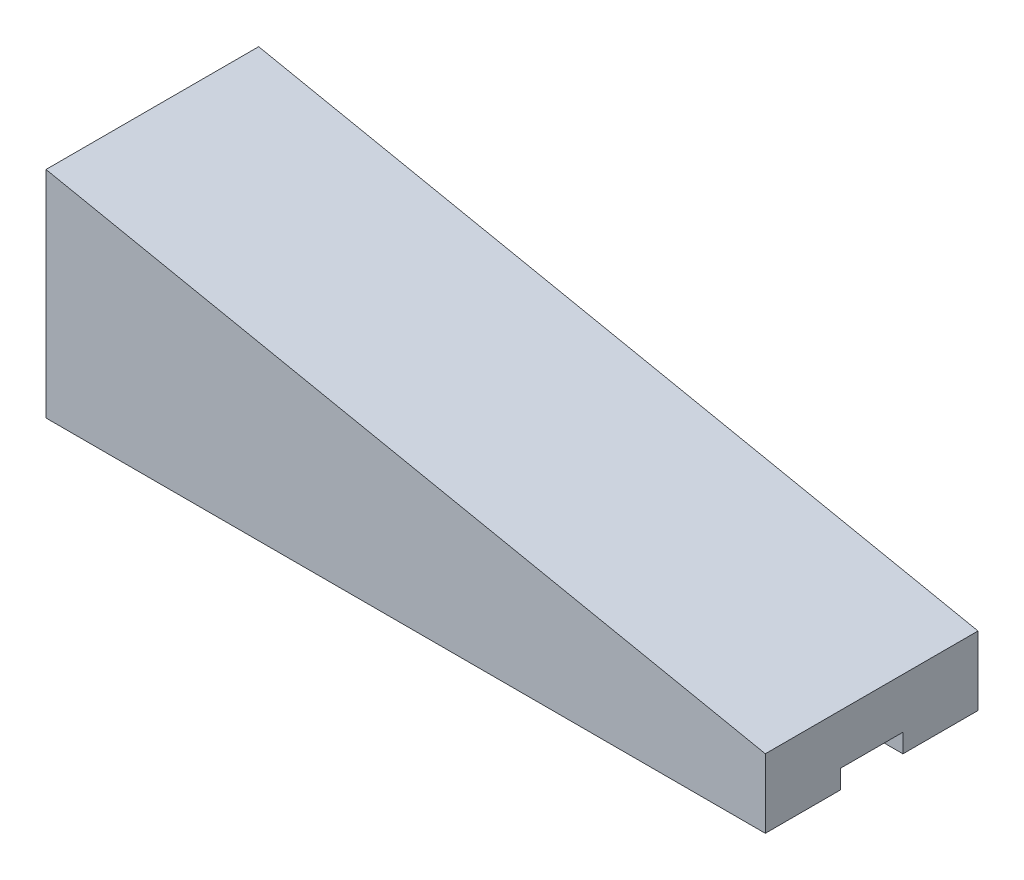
ISO-10303-21;
HEADER;
FILE_DESCRIPTION(('STEP AP214'),'2;1');
FILE_NAME('part.step','',(''),(''),'','','');
FILE_SCHEMA(('AUTOMOTIVE_DESIGN { 1 0 10303 214 1 1 1 1 }'));
ENDSEC;
DATA;
#1=APPLICATION_CONTEXT('core data for automotive mechanical design processes');
#2=APPLICATION_PROTOCOL_DEFINITION('international standard','automotive_design',2000,#1);
#3=PRODUCT_CONTEXT('',#1,'mechanical');
#4=PRODUCT('Part','Part','',(#3));
#5=PRODUCT_RELATED_PRODUCT_CATEGORY('part','',(#4));
#6=PRODUCT_DEFINITION_FORMATION('','',#4);
#7=PRODUCT_DEFINITION_CONTEXT('part definition',#1,'design');
#8=PRODUCT_DEFINITION('design','',#6,#7);
#9=PRODUCT_DEFINITION_SHAPE('','',#8);
#10=(LENGTH_UNIT() NAMED_UNIT(*) SI_UNIT(.MILLI.,.METRE.));
#11=(NAMED_UNIT(*) PLANE_ANGLE_UNIT() SI_UNIT($,.RADIAN.));
#12=(NAMED_UNIT(*) SI_UNIT($,.STERADIAN.) SOLID_ANGLE_UNIT());
#13=UNCERTAINTY_MEASURE_WITH_UNIT(LENGTH_MEASURE(1.E-05),#10,'distance_accuracy_value','');
#14=(GEOMETRIC_REPRESENTATION_CONTEXT(3) GLOBAL_UNCERTAINTY_ASSIGNED_CONTEXT((#13)) GLOBAL_UNIT_ASSIGNED_CONTEXT((#10,
#11,#12)) REPRESENTATION_CONTEXT('',''));
#15=CARTESIAN_POINT('',(0.,0.,0.));
#16=DIRECTION('',(0.,0.,1.));
#17=DIRECTION('',(1.,0.,0.));
#18=AXIS2_PLACEMENT_3D('',#15,#16,#17);
#19=CARTESIAN_POINT('',(-187.958768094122,40.,34.));
#20=DIRECTION('',(1.,0.,0.));
#21=DIRECTION('',(0.,0.,-1.));
#22=AXIS2_PLACEMENT_3D('',#19,#20,#21);
#23=CYLINDRICAL_SURFACE('',#22,22.);
#24=CARTESIAN_POINT('',(-177.958768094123,40.,34.));
#25=DIRECTION('',(1.,0.,0.));
#26=DIRECTION('',(0.,0.,-1.));
#27=AXIS2_PLACEMENT_3D('',#24,#25,#26);
#28=CIRCLE('',#27,22.);
#29=CARTESIAN_POINT('',(-177.958768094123,40.,12.));
#30=VERTEX_POINT('',#29);
#31=CARTESIAN_POINT('',(-177.958768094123,42.0540601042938,55.9039000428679));
#32=VERTEX_POINT('',#31);
#33=EDGE_CURVE('E20',#30,#32,#28,.T.);
#34=ORIENTED_EDGE('',*,*,#33,.T.);
#35=DIRECTION('',(1.,0.,0.));
#36=VECTOR('',#35,1.);
#37=CARTESIAN_POINT('',(-187.958768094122,42.0540601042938,55.9039000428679));
#38=LINE('',#37,#36);
#39=CARTESIAN_POINT('',(-187.958768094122,42.0540601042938,55.9039000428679));
#40=VERTEX_POINT('',#39);
#41=EDGE_CURVE('E122',#32,#40,#38,.F.);
#42=ORIENTED_EDGE('',*,*,#41,.T.);
#43=CARTESIAN_POINT('',(-187.958768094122,40.,34.));
#44=DIRECTION('',(1.,0.,0.));
#45=DIRECTION('',(0.,0.,-1.));
#46=AXIS2_PLACEMENT_3D('',#43,#44,#45);
#47=CIRCLE('',#46,22.);
#48=CARTESIAN_POINT('',(-187.958768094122,40.,12.));
#49=VERTEX_POINT('',#48);
#50=EDGE_CURVE('E126',#49,#40,#47,.T.);
#51=ORIENTED_EDGE('',*,*,#50,.F.);
#52=DIRECTION('',(-1.,0.,0.));
#53=VECTOR('',#52,1.);
#54=CARTESIAN_POINT('',(-187.958768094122,40.,12.));
#55=LINE('',#54,#53);
#56=EDGE_CURVE('E124',#49,#30,#55,.F.);
#57=ORIENTED_EDGE('',*,*,#56,.T.);
#58=EDGE_LOOP('',(#34,#42,#51,#57));
#59=FACE_BOUND('',#58,.T.);
#60=ADVANCED_FACE('F16',(#59),#23,.F.);
#61=CARTESIAN_POINT('',(-187.958768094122,37.9459398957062,55.9039000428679));
#62=DIRECTION('',(0.,0.,1.));
#63=DIRECTION('',(1.,0.,0.));
#64=AXIS2_PLACEMENT_3D('',#61,#62,#63);
#65=PLANE('',#64);
#66=DIRECTION('',(1.,0.,0.));
#67=VECTOR('',#66,1.);
#68=CARTESIAN_POINT('',(32.0412319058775,0.,55.9039000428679));
#69=LINE('',#68,#67);
#70=CARTESIAN_POINT('',(-187.958768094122,0.,55.9039000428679));
#71=VERTEX_POINT('',#70);
#72=CARTESIAN_POINT('',(-177.958768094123,0.,55.9039000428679));
#73=VERTEX_POINT('',#72);
#74=EDGE_CURVE('E146',#71,#73,#69,.T.);
#75=ORIENTED_EDGE('',*,*,#74,.F.);
#76=DIRECTION('',(0.,1.,0.));
#77=VECTOR('',#76,1.);
#78=CARTESIAN_POINT('',(-187.958768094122,27.1693685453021,55.9039000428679));
#79=LINE('',#78,#77);
#80=EDGE_CURVE('E177',#40,#71,#79,.F.);
#81=ORIENTED_EDGE('',*,*,#80,.F.);
#82=ORIENTED_EDGE('',*,*,#41,.F.);
#83=DIRECTION('',(0.,1.,0.));
#84=VECTOR('',#83,1.);
#85=CARTESIAN_POINT('',(-177.958768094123,27.1693685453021,55.9039000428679));
#86=LINE('',#85,#84);
#87=EDGE_CURVE('E121',#32,#73,#86,.F.);
#88=ORIENTED_EDGE('',*,*,#87,.T.);
#89=EDGE_LOOP('',(#75,#81,#82,#88));
#90=FACE_BOUND('',#89,.T.);
#91=ADVANCED_FACE('F353',(#90),#65,.F.);
#92=CARTESIAN_POINT('',(-177.958768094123,27.1693685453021,33.9895489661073));
#93=DIRECTION('',(1.,0.,0.));
#94=DIRECTION('',(0.,0.,-1.));
#95=AXIS2_PLACEMENT_3D('',#92,#93,#94);
#96=PLANE('',#95);
#97=DIRECTION('',(0.,0.,1.));
#98=VECTOR('',#97,1.);
#99=CARTESIAN_POINT('',(-177.958768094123,6.,44.));
#100=LINE('',#99,#98);
#101=CARTESIAN_POINT('',(-177.958768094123,6.,24.));
#102=VERTEX_POINT('',#101);
#103=CARTESIAN_POINT('',(-177.958768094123,6.,44.));
#104=VERTEX_POINT('',#103);
#105=EDGE_CURVE('E150',#102,#104,#100,.T.);
#106=ORIENTED_EDGE('',*,*,#105,.T.);
#107=DIRECTION('',(0.,1.,0.));
#108=VECTOR('',#107,1.);
#109=CARTESIAN_POINT('',(-177.958768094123,0.,44.));
#110=LINE('',#109,#108);
#111=CARTESIAN_POINT('',(-177.958768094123,0.,44.));
#112=VERTEX_POINT('',#111);
#113=EDGE_CURVE('E184',#104,#112,#110,.F.);
#114=ORIENTED_EDGE('',*,*,#113,.T.);
#115=DIRECTION('',(0.,0.,-1.));
#116=VECTOR('',#115,1.);
#117=CARTESIAN_POINT('',(-177.958768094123,0.,0.));
#118=LINE('',#117,#116);
#119=EDGE_CURVE('E162',#73,#112,#118,.T.);
#120=ORIENTED_EDGE('',*,*,#119,.F.);
#121=ORIENTED_EDGE('',*,*,#87,.F.);
#122=ORIENTED_EDGE('',*,*,#33,.F.);
#123=DIRECTION('',(0.,1.,0.));
#124=VECTOR('',#123,1.);
#125=CARTESIAN_POINT('',(-177.958768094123,40.,12.));
#126=LINE('',#125,#124);
#127=CARTESIAN_POINT('',(-177.958768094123,0.,12.));
#128=VERTEX_POINT('',#127);
#129=EDGE_CURVE('E118',#30,#128,#126,.F.);
#130=ORIENTED_EDGE('',*,*,#129,.T.);
#131=DIRECTION('',(0.,0.,-1.));
#132=VECTOR('',#131,1.);
#133=CARTESIAN_POINT('',(-177.958768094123,0.,0.));
#134=LINE('',#133,#132);
#135=CARTESIAN_POINT('',(-177.958768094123,0.,24.));
#136=VERTEX_POINT('',#135);
#137=EDGE_CURVE('E159',#136,#128,#134,.T.);
#138=ORIENTED_EDGE('',*,*,#137,.F.);
#139=DIRECTION('',(0.,1.,0.));
#140=VECTOR('',#139,1.);
#141=CARTESIAN_POINT('',(-177.958768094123,6.,24.));
#142=LINE('',#141,#140);
#143=EDGE_CURVE('E179',#136,#102,#142,.T.);
#144=ORIENTED_EDGE('',*,*,#143,.T.);
#145=EDGE_LOOP('',(#106,#114,#120,#121,#122,#130,#138,#144));
#146=FACE_BOUND('',#145,.T.);
#147=ADVANCED_FACE('F116',(#146),#96,.F.);
#148=CARTESIAN_POINT('',(-187.958768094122,40.,12.));
#149=DIRECTION('',(0.,0.,-1.));
#150=DIRECTION('',(-1.,0.,0.));
#151=AXIS2_PLACEMENT_3D('',#148,#149,#150);
#152=PLANE('',#151);
#153=ORIENTED_EDGE('',*,*,#56,.F.);
#154=DIRECTION('',(0.,1.,0.));
#155=VECTOR('',#154,1.);
#156=CARTESIAN_POINT('',(-187.958768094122,27.1693685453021,12.));
#157=LINE('',#156,#155);
#158=CARTESIAN_POINT('',(-187.958768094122,0.,12.));
#159=VERTEX_POINT('',#158);
#160=EDGE_CURVE('E134',#159,#49,#157,.T.);
#161=ORIENTED_EDGE('',*,*,#160,.F.);
#162=DIRECTION('',(1.,0.,0.));
#163=VECTOR('',#162,1.);
#164=CARTESIAN_POINT('',(32.0412319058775,0.,12.));
#165=LINE('',#164,#163);
#166=EDGE_CURVE('E132',#128,#159,#165,.F.);
#167=ORIENTED_EDGE('',*,*,#166,.F.);
#168=ORIENTED_EDGE('',*,*,#129,.F.);
#169=EDGE_LOOP('',(#153,#161,#167,#168));
#170=FACE_BOUND('',#169,.T.);
#171=ADVANCED_FACE('F130',(#170),#152,.F.);
#172=CARTESIAN_POINT('',(-187.958768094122,27.1693685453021,33.9895489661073));
#173=DIRECTION('',(1.,0.,0.));
#174=DIRECTION('',(0.,0.,-1.));
#175=AXIS2_PLACEMENT_3D('',#172,#173,#174);
#176=PLANE('',#175);
#177=DIRECTION('',(0.,1.,0.));
#178=VECTOR('',#177,1.);
#179=CARTESIAN_POINT('',(-187.958768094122,0.,47.));
#180=LINE('',#179,#178);
#181=CARTESIAN_POINT('',(-187.958768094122,0.,47.));
#182=VERTEX_POINT('',#181);
#183=CARTESIAN_POINT('',(-187.958768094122,40.,47.));
#184=VERTEX_POINT('',#183);
#185=EDGE_CURVE('E152',#182,#184,#180,.T.);
#186=ORIENTED_EDGE('',*,*,#185,.T.);
#187=CARTESIAN_POINT('',(-187.958768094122,40.,34.));
#188=DIRECTION('',(1.,0.,0.));
#189=DIRECTION('',(0.,0.,-1.));
#190=AXIS2_PLACEMENT_3D('',#187,#188,#189);
#191=CIRCLE('',#190,13.);
#192=CARTESIAN_POINT('',(-187.958768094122,40.,21.));
#193=VERTEX_POINT('',#192);
#194=EDGE_CURVE('E173',#184,#193,#191,.F.);
#195=ORIENTED_EDGE('',*,*,#194,.T.);
#196=DIRECTION('',(0.,1.,0.));
#197=VECTOR('',#196,1.);
#198=CARTESIAN_POINT('',(-187.958768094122,40.,21.));
#199=LINE('',#198,#197);
#200=CARTESIAN_POINT('',(-187.958768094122,0.,21.));
#201=VERTEX_POINT('',#200);
#202=EDGE_CURVE('E235',#193,#201,#199,.F.);
#203=ORIENTED_EDGE('',*,*,#202,.T.);
#204=DIRECTION('',(0.,0.,-1.));
#205=VECTOR('',#204,1.);
#206=CARTESIAN_POINT('',(-187.958768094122,0.,0.));
#207=LINE('',#206,#205);
#208=EDGE_CURVE('E281',#159,#201,#207,.F.);
#209=ORIENTED_EDGE('',*,*,#208,.F.);
#210=ORIENTED_EDGE('',*,*,#160,.T.);
#211=ORIENTED_EDGE('',*,*,#50,.T.);
#212=ORIENTED_EDGE('',*,*,#80,.T.);
#213=DIRECTION('',(0.,0.,-1.));
#214=VECTOR('',#213,1.);
#215=CARTESIAN_POINT('',(-187.958768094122,0.,0.));
#216=LINE('',#215,#214);
#217=EDGE_CURVE('E143',#182,#71,#216,.F.);
#218=ORIENTED_EDGE('',*,*,#217,.F.);
#219=EDGE_LOOP('',(#186,#195,#203,#209,#210,#211,#212,#218));
#220=FACE_BOUND('',#219,.T.);
#221=ADVANCED_FACE('F396',(#220),#176,.T.);
#222=CARTESIAN_POINT('',(-197.958768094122,6.,24.));
#223=DIRECTION('',(0.,0.,-1.));
#224=DIRECTION('',(-1.,0.,0.));
#225=AXIS2_PLACEMENT_3D('',#222,#223,#224);
#226=PLANE('',#225);
#227=DIRECTION('',(1.,0.,0.));
#228=VECTOR('',#227,1.);
#229=CARTESIAN_POINT('',(32.0412319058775,0.,24.));
#230=LINE('',#229,#228);
#231=CARTESIAN_POINT('',(32.0412319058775,0.,24.));
#232=VERTEX_POINT('',#231);
#233=EDGE_CURVE('E240',#232,#136,#230,.F.);
#234=ORIENTED_EDGE('',*,*,#233,.F.);
#235=DIRECTION('',(0.,1.,0.));
#236=VECTOR('',#235,1.);
#237=CARTESIAN_POINT('',(32.0412319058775,22.034522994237,24.));
#238=LINE('',#237,#236);
#239=CARTESIAN_POINT('',(32.0412319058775,6.,24.));
#240=VERTEX_POINT('',#239);
#241=EDGE_CURVE('E203',#240,#232,#238,.F.);
#242=ORIENTED_EDGE('',*,*,#241,.F.);
#243=DIRECTION('',(1.,0.,0.));
#244=VECTOR('',#243,1.);
#245=CARTESIAN_POINT('',(-197.958768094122,6.,24.));
#246=LINE('',#245,#244);
#247=EDGE_CURVE('E153',#240,#102,#246,.F.);
#248=ORIENTED_EDGE('',*,*,#247,.T.);
#249=ORIENTED_EDGE('',*,*,#143,.F.);
#250=EDGE_LOOP('',(#234,#242,#248,#249));
#251=FACE_BOUND('',#250,.T.);
#252=ADVANCED_FACE('F316',(#251),#226,.F.);
#253=CARTESIAN_POINT('',(-197.958768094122,0.,44.));
#254=DIRECTION('',(0.,0.,1.));
#255=DIRECTION('',(1.,0.,0.));
#256=AXIS2_PLACEMENT_3D('',#253,#254,#255);
#257=PLANE('',#256);
#258=DIRECTION('',(1.,0.,0.));
#259=VECTOR('',#258,1.);
#260=CARTESIAN_POINT('',(-197.958768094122,6.,44.));
#261=LINE('',#260,#259);
#262=CARTESIAN_POINT('',(32.0412319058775,6.,44.));
#263=VERTEX_POINT('',#262);
#264=EDGE_CURVE('E196',#104,#263,#261,.T.);
#265=ORIENTED_EDGE('',*,*,#264,.T.);
#266=DIRECTION('',(0.,1.,0.));
#267=VECTOR('',#266,1.);
#268=CARTESIAN_POINT('',(32.0412319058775,22.034522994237,44.));
#269=LINE('',#268,#267);
#270=CARTESIAN_POINT('',(32.0412319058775,0.,44.));
#271=VERTEX_POINT('',#270);
#272=EDGE_CURVE('E204',#271,#263,#269,.T.);
#273=ORIENTED_EDGE('',*,*,#272,.F.);
#274=DIRECTION('',(1.,0.,0.));
#275=VECTOR('',#274,1.);
#276=CARTESIAN_POINT('',(32.0412319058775,0.,44.));
#277=LINE('',#276,#275);
#278=EDGE_CURVE('E165',#112,#271,#277,.T.);
#279=ORIENTED_EDGE('',*,*,#278,.F.);
#280=ORIENTED_EDGE('',*,*,#113,.F.);
#281=EDGE_LOOP('',(#265,#273,#279,#280));
#282=FACE_BOUND('',#281,.T.);
#283=ADVANCED_FACE('F351',(#282),#257,.F.);
#284=CARTESIAN_POINT('',(-197.958768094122,6.,44.));
#285=DIRECTION('',(0.,1.,0.));
#286=DIRECTION('',(0.,0.,1.));
#287=AXIS2_PLACEMENT_3D('',#284,#285,#286);
#288=PLANE('',#287);
#289=ORIENTED_EDGE('',*,*,#247,.F.);
#290=DIRECTION('',(0.,0.,-1.));
#291=VECTOR('',#290,1.);
#292=CARTESIAN_POINT('',(32.0412319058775,6.,0.));
#293=LINE('',#292,#291);
#294=EDGE_CURVE('E207',#263,#240,#293,.T.);
#295=ORIENTED_EDGE('',*,*,#294,.F.);
#296=ORIENTED_EDGE('',*,*,#264,.F.);
#297=ORIENTED_EDGE('',*,*,#105,.F.);
#298=EDGE_LOOP('',(#289,#295,#296,#297));
#299=FACE_BOUND('',#298,.T.);
#300=ADVANCED_FACE('F322',(#299),#288,.F.);
#301=CARTESIAN_POINT('',(-197.958768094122,0.,47.));
#302=DIRECTION('',(0.,0.,1.));
#303=DIRECTION('',(1.,0.,0.));
#304=AXIS2_PLACEMENT_3D('',#301,#302,#303);
#305=PLANE('',#304);
#306=DIRECTION('',(1.,0.,0.));
#307=VECTOR('',#306,1.);
#308=CARTESIAN_POINT('',(32.0412319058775,0.,47.));
#309=LINE('',#308,#307);
#310=CARTESIAN_POINT('',(-197.958768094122,0.,47.));
#311=VERTEX_POINT('',#310);
#312=EDGE_CURVE('E147',#311,#182,#309,.T.);
#313=ORIENTED_EDGE('',*,*,#312,.F.);
#314=DIRECTION('',(0.,1.,0.));
#315=VECTOR('',#314,1.);
#316=CARTESIAN_POINT('',(-197.958768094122,0.,47.));
#317=LINE('',#316,#315);
#318=CARTESIAN_POINT('',(-197.958768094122,40.,47.));
#319=VERTEX_POINT('',#318);
#320=EDGE_CURVE('E224',#319,#311,#317,.F.);
#321=ORIENTED_EDGE('',*,*,#320,.F.);
#322=DIRECTION('',(1.,0.,0.));
#323=VECTOR('',#322,1.);
#324=CARTESIAN_POINT('',(-197.958768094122,40.,47.));
#325=LINE('',#324,#323);
#326=EDGE_CURVE('E176',#319,#184,#325,.T.);
#327=ORIENTED_EDGE('',*,*,#326,.T.);
#328=ORIENTED_EDGE('',*,*,#185,.F.);
#329=EDGE_LOOP('',(#313,#321,#327,#328));
#330=FACE_BOUND('',#329,.T.);
#331=ADVANCED_FACE('F386',(#330),#305,.F.);
#332=CARTESIAN_POINT('',(32.0412319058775,0.,0.));
#333=DIRECTION('',(0.,-1.,0.));
#334=DIRECTION('',(0.,0.,-1.));
#335=AXIS2_PLACEMENT_3D('',#332,#333,#334);
#336=PLANE('',#335);
#337=ORIENTED_EDGE('',*,*,#217,.T.);
#338=ORIENTED_EDGE('',*,*,#74,.T.);
#339=ORIENTED_EDGE('',*,*,#119,.T.);
#340=ORIENTED_EDGE('',*,*,#278,.T.);
#341=DIRECTION('',(0.,0.,-1.));
#342=VECTOR('',#341,1.);
#343=CARTESIAN_POINT('',(32.0412319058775,0.,0.));
#344=LINE('',#343,#342);
#345=CARTESIAN_POINT('',(32.0412319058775,0.,68.));
#346=VERTEX_POINT('',#345);
#347=EDGE_CURVE('E208',#346,#271,#344,.T.);
#348=ORIENTED_EDGE('',*,*,#347,.F.);
#349=DIRECTION('',(1.,0.,0.));
#350=VECTOR('',#349,1.);
#351=CARTESIAN_POINT('',(-92.6447933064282,0.,68.));
#352=LINE('',#351,#350);
#353=CARTESIAN_POINT('',(-197.958768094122,0.,68.));
#354=VERTEX_POINT('',#353);
#355=EDGE_CURVE('E175',#354,#346,#352,.T.);
#356=ORIENTED_EDGE('',*,*,#355,.F.);
#357=DIRECTION('',(0.,0.,1.));
#358=VECTOR('',#357,1.);
#359=CARTESIAN_POINT('',(-197.958768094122,0.,0.));
#360=LINE('',#359,#358);
#361=EDGE_CURVE('E223',#311,#354,#360,.T.);
#362=ORIENTED_EDGE('',*,*,#361,.F.);
#363=ORIENTED_EDGE('',*,*,#312,.T.);
#364=EDGE_LOOP('',(#337,#338,#339,#340,#348,#356,#362,#363));
#365=FACE_BOUND('',#364,.T.);
#366=ADVANCED_FACE('F349',(#365),#336,.T.);
#367=CARTESIAN_POINT('',(32.0412319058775,0.,0.));
#368=DIRECTION('',(0.,-1.,0.));
#369=DIRECTION('',(0.,0.,-1.));
#370=AXIS2_PLACEMENT_3D('',#367,#368,#369);
#371=PLANE('',#370);
#372=DIRECTION('',(0.,0.,-1.));
#373=VECTOR('',#372,1.);
#374=CARTESIAN_POINT('',(32.0412319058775,0.,0.));
#375=LINE('',#374,#373);
#376=CARTESIAN_POINT('',(32.0412319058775,0.,0.));
#377=VERTEX_POINT('',#376);
#378=EDGE_CURVE('E214',#232,#377,#375,.T.);
#379=ORIENTED_EDGE('',*,*,#378,.F.);
#380=ORIENTED_EDGE('',*,*,#233,.T.);
#381=ORIENTED_EDGE('',*,*,#137,.T.);
#382=ORIENTED_EDGE('',*,*,#166,.T.);
#383=ORIENTED_EDGE('',*,*,#208,.T.);
#384=DIRECTION('',(-1.,0.,0.));
#385=VECTOR('',#384,1.);
#386=CARTESIAN_POINT('',(-197.958768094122,0.,21.));
#387=LINE('',#386,#385);
#388=CARTESIAN_POINT('',(-197.958768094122,0.,21.));
#389=VERTEX_POINT('',#388);
#390=EDGE_CURVE('E238',#201,#389,#387,.T.);
#391=ORIENTED_EDGE('',*,*,#390,.T.);
#392=DIRECTION('',(0.,0.,1.));
#393=VECTOR('',#392,1.);
#394=CARTESIAN_POINT('',(-197.958768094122,0.,0.));
#395=LINE('',#394,#393);
#396=CARTESIAN_POINT('',(-197.958768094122,0.,0.));
#397=VERTEX_POINT('',#396);
#398=EDGE_CURVE('E217',#397,#389,#395,.T.);
#399=ORIENTED_EDGE('',*,*,#398,.F.);
#400=DIRECTION('',(1.,0.,0.));
#401=VECTOR('',#400,1.);
#402=CARTESIAN_POINT('',(-92.6447933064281,0.,0.));
#403=LINE('',#402,#401);
#404=EDGE_CURVE('E227',#397,#377,#403,.T.);
#405=ORIENTED_EDGE('',*,*,#404,.T.);
#406=EDGE_LOOP('',(#379,#380,#381,#382,#383,#391,#399,#405));
#407=FACE_BOUND('',#406,.T.);
#408=ADVANCED_FACE('F312',(#407),#371,.T.);
#409=CARTESIAN_POINT('',(-197.958768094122,40.,21.));
#410=DIRECTION('',(0.,0.,-1.));
#411=DIRECTION('',(-1.,0.,0.));
#412=AXIS2_PLACEMENT_3D('',#409,#410,#411);
#413=PLANE('',#412);
#414=DIRECTION('',(1.,0.,0.));
#415=VECTOR('',#414,1.);
#416=CARTESIAN_POINT('',(-197.958768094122,40.,21.));
#417=LINE('',#416,#415);
#418=CARTESIAN_POINT('',(-197.958768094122,40.,21.));
#419=VERTEX_POINT('',#418);
#420=EDGE_CURVE('E233',#193,#419,#417,.F.);
#421=ORIENTED_EDGE('',*,*,#420,.T.);
#422=DIRECTION('',(0.,1.,0.));
#423=VECTOR('',#422,1.);
#424=CARTESIAN_POINT('',(-197.958768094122,0.,21.));
#425=LINE('',#424,#423);
#426=EDGE_CURVE('E172',#389,#419,#425,.T.);
#427=ORIENTED_EDGE('',*,*,#426,.F.);
#428=ORIENTED_EDGE('',*,*,#390,.F.);
#429=ORIENTED_EDGE('',*,*,#202,.F.);
#430=EDGE_LOOP('',(#421,#427,#428,#429));
#431=FACE_BOUND('',#430,.T.);
#432=ADVANCED_FACE('F377',(#431),#413,.F.);
#433=CARTESIAN_POINT('',(-197.958768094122,40.,34.));
#434=DIRECTION('',(1.,0.,0.));
#435=DIRECTION('',(0.,0.,-1.));
#436=AXIS2_PLACEMENT_3D('',#433,#434,#435);
#437=CYLINDRICAL_SURFACE('',#436,13.);
#438=ORIENTED_EDGE('',*,*,#326,.F.);
#439=CARTESIAN_POINT('',(-197.958768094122,40.,34.));
#440=DIRECTION('',(1.,0.,0.));
#441=DIRECTION('',(0.,0.,-1.));
#442=AXIS2_PLACEMENT_3D('',#439,#440,#441);
#443=CIRCLE('',#442,13.);
#444=EDGE_CURVE('E168',#419,#319,#443,.T.);
#445=ORIENTED_EDGE('',*,*,#444,.F.);
#446=ORIENTED_EDGE('',*,*,#420,.F.);
#447=ORIENTED_EDGE('',*,*,#194,.F.);
#448=EDGE_LOOP('',(#438,#445,#446,#447));
#449=FACE_BOUND('',#448,.T.);
#450=ADVANCED_FACE('F374',(#449),#437,.F.);
#451=CARTESIAN_POINT('',(-92.6447933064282,23.8937464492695,68.));
#452=DIRECTION('',(0.,0.,1.));
#453=DIRECTION('',(1.,0.,0.));
#454=AXIS2_PLACEMENT_3D('',#451,#452,#453);
#455=PLANE('',#454);
#456=DIRECTION('',(0.,1.,0.));
#457=VECTOR('',#456,1.);
#458=CARTESIAN_POINT('',(32.0412319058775,22.034522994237,68.));
#459=LINE('',#458,#457);
#460=CARTESIAN_POINT('',(32.0412319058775,22.034522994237,68.));
#461=VERTEX_POINT('',#460);
#462=EDGE_CURVE('E211',#461,#346,#459,.F.);
#463=ORIENTED_EDGE('',*,*,#462,.F.);
#464=DIRECTION('',(-0.97992470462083,0.199367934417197,0.));
#465=VECTOR('',#464,1.);
#466=CARTESIAN_POINT('',(-197.958768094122,68.8285518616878,68.));
#467=LINE('',#466,#465);
#468=CARTESIAN_POINT('',(-197.958768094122,68.8285518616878,68.));
#469=VERTEX_POINT('',#468);
#470=EDGE_CURVE('E171',#469,#461,#467,.F.);
#471=ORIENTED_EDGE('',*,*,#470,.F.);
#472=DIRECTION('',(0.,1.,0.));
#473=VECTOR('',#472,1.);
#474=CARTESIAN_POINT('',(-197.958768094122,0.,68.));
#475=LINE('',#474,#473);
#476=EDGE_CURVE('E220',#354,#469,#475,.T.);
#477=ORIENTED_EDGE('',*,*,#476,.F.);
#478=ORIENTED_EDGE('',*,*,#355,.T.);
#479=EDGE_LOOP('',(#463,#471,#477,#478));
#480=FACE_BOUND('',#479,.T.);
#481=ADVANCED_FACE('F339',(#480),#455,.T.);
#482=CARTESIAN_POINT('',(32.0412319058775,22.034522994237,0.));
#483=DIRECTION('',(1.,0.,0.));
#484=DIRECTION('',(0.,0.,-1.));
#485=AXIS2_PLACEMENT_3D('',#482,#483,#484);
#486=PLANE('',#485);
#487=ORIENTED_EDGE('',*,*,#272,.T.);
#488=ORIENTED_EDGE('',*,*,#294,.T.);
#489=ORIENTED_EDGE('',*,*,#241,.T.);
#490=ORIENTED_EDGE('',*,*,#378,.T.);
#491=DIRECTION('',(0.,1.,0.));
#492=VECTOR('',#491,1.);
#493=CARTESIAN_POINT('',(32.0412319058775,23.8937464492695,0.));
#494=LINE('',#493,#492);
#495=CARTESIAN_POINT('',(32.0412319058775,22.034522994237,0.));
#496=VERTEX_POINT('',#495);
#497=EDGE_CURVE('E252',#377,#496,#494,.T.);
#498=ORIENTED_EDGE('',*,*,#497,.T.);
#499=DIRECTION('',(0.,0.,1.));
#500=VECTOR('',#499,1.);
#501=CARTESIAN_POINT('',(32.0412319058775,22.034522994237,0.));
#502=LINE('',#501,#500);
#503=EDGE_CURVE('E232',#461,#496,#502,.F.);
#504=ORIENTED_EDGE('',*,*,#503,.F.);
#505=ORIENTED_EDGE('',*,*,#462,.T.);
#506=ORIENTED_EDGE('',*,*,#347,.T.);
#507=EDGE_LOOP('',(#487,#488,#489,#490,#498,#504,#505,#506));
#508=FACE_BOUND('',#507,.T.);
#509=ADVANCED_FACE('F342',(#508),#486,.T.);
#510=CARTESIAN_POINT('',(-92.6447933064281,23.8937464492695,0.));
#511=DIRECTION('',(0.,0.,1.));
#512=DIRECTION('',(1.,0.,0.));
#513=AXIS2_PLACEMENT_3D('',#510,#511,#512);
#514=PLANE('',#513);
#515=DIRECTION('',(0.,1.,0.));
#516=VECTOR('',#515,1.);
#517=CARTESIAN_POINT('',(-197.958768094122,0.,0.));
#518=LINE('',#517,#516);
#519=CARTESIAN_POINT('',(-197.958768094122,68.8285518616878,0.));
#520=VERTEX_POINT('',#519);
#521=EDGE_CURVE('E35',#520,#397,#518,.F.);
#522=ORIENTED_EDGE('',*,*,#521,.F.);
#523=DIRECTION('',(-0.97992470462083,0.199367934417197,0.));
#524=VECTOR('',#523,1.);
#525=CARTESIAN_POINT('',(-197.958768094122,68.8285518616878,0.));
#526=LINE('',#525,#524);
#527=EDGE_CURVE('E26',#496,#520,#526,.T.);
#528=ORIENTED_EDGE('',*,*,#527,.F.);
#529=ORIENTED_EDGE('',*,*,#497,.F.);
#530=ORIENTED_EDGE('',*,*,#404,.F.);
#531=EDGE_LOOP('',(#522,#528,#529,#530));
#532=FACE_BOUND('',#531,.T.);
#533=ADVANCED_FACE('F365',(#532),#514,.F.);
#534=CARTESIAN_POINT('',(-197.958768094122,0.,0.));
#535=DIRECTION('',(-1.,0.,0.));
#536=DIRECTION('',(0.,0.,1.));
#537=AXIS2_PLACEMENT_3D('',#534,#535,#536);
#538=PLANE('',#537);
#539=ORIENTED_EDGE('',*,*,#426,.T.);
#540=ORIENTED_EDGE('',*,*,#444,.T.);
#541=ORIENTED_EDGE('',*,*,#320,.T.);
#542=ORIENTED_EDGE('',*,*,#361,.T.);
#543=ORIENTED_EDGE('',*,*,#476,.T.);
#544=DIRECTION('',(0.,0.,1.));
#545=VECTOR('',#544,1.);
#546=CARTESIAN_POINT('',(-197.958768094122,68.8285518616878,0.));
#547=LINE('',#546,#545);
#548=EDGE_CURVE('E10',#520,#469,#547,.T.);
#549=ORIENTED_EDGE('',*,*,#548,.F.);
#550=ORIENTED_EDGE('',*,*,#521,.T.);
#551=ORIENTED_EDGE('',*,*,#398,.T.);
#552=EDGE_LOOP('',(#539,#540,#541,#542,#543,#549,#550,#551));
#553=FACE_BOUND('',#552,.T.);
#554=ADVANCED_FACE('F346',(#553),#538,.T.);
#555=CARTESIAN_POINT('',(-197.958768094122,68.8285518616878,0.));
#556=DIRECTION('',(0.199367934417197,0.97992470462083,0.));
#557=DIRECTION('',(-0.97992470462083,0.199367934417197,0.));
#558=AXIS2_PLACEMENT_3D('',#555,#556,#557);
#559=PLANE('',#558);
#560=ORIENTED_EDGE('',*,*,#527,.T.);
#561=ORIENTED_EDGE('',*,*,#548,.T.);
#562=ORIENTED_EDGE('',*,*,#470,.T.);
#563=ORIENTED_EDGE('',*,*,#503,.T.);
#564=EDGE_LOOP('',(#560,#561,#562,#563));
#565=FACE_BOUND('',#564,.T.);
#566=ADVANCED_FACE('F18',(#565),#559,.T.);
#567=CLOSED_SHELL('',(#60,#91,#147,#171,#221,#252,#283,#300,#331,#366,#408,#432,#450,#481,#509,
#533,#554,#566));
#568=MANIFOLD_SOLID_BREP('B1',#567);
#569=ADVANCED_BREP_SHAPE_REPRESENTATION('',(#18,#568),#14);
#570=SHAPE_DEFINITION_REPRESENTATION(#9,#569);
ENDSEC;
END-ISO-10303-21;
